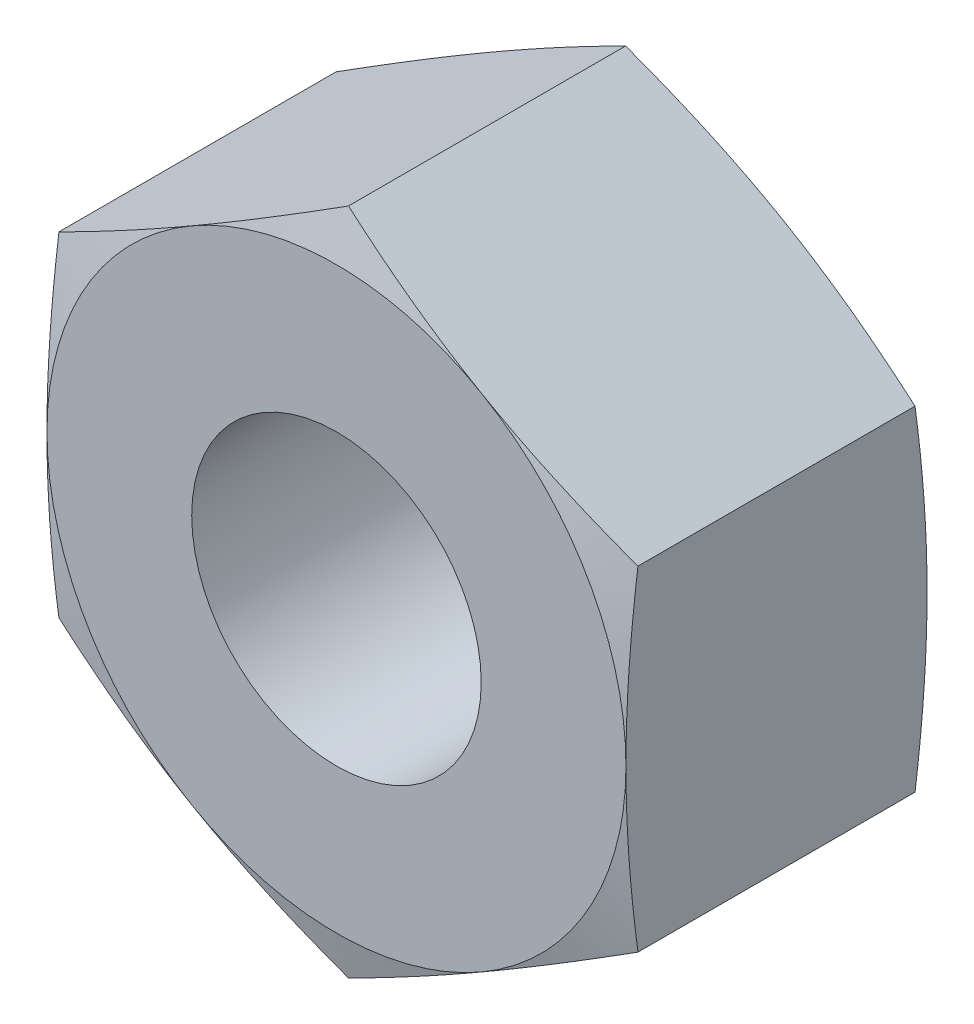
ISO-10303-21;
HEADER;
FILE_DESCRIPTION(('STEP AP214'),'2;1');
FILE_NAME('part.step','',(''),(''),'','','');
FILE_SCHEMA(('AUTOMOTIVE_DESIGN { 1 0 10303 214 1 1 1 1 }'));
ENDSEC;
DATA;
#1=APPLICATION_CONTEXT('core data for automotive mechanical design processes');
#2=APPLICATION_PROTOCOL_DEFINITION('international standard','automotive_design',2000,#1);
#3=PRODUCT_CONTEXT('',#1,'mechanical');
#4=PRODUCT('Part','Part','',(#3));
#5=PRODUCT_RELATED_PRODUCT_CATEGORY('part','',(#4));
#6=PRODUCT_DEFINITION_FORMATION('','',#4);
#7=PRODUCT_DEFINITION_CONTEXT('part definition',#1,'design');
#8=PRODUCT_DEFINITION('design','',#6,#7);
#9=PRODUCT_DEFINITION_SHAPE('','',#8);
#10=(LENGTH_UNIT() NAMED_UNIT(*) SI_UNIT(.MILLI.,.METRE.));
#11=(NAMED_UNIT(*) PLANE_ANGLE_UNIT() SI_UNIT($,.RADIAN.));
#12=(NAMED_UNIT(*) SI_UNIT($,.STERADIAN.) SOLID_ANGLE_UNIT());
#13=UNCERTAINTY_MEASURE_WITH_UNIT(LENGTH_MEASURE(1.E-05),#10,'distance_accuracy_value','');
#14=(GEOMETRIC_REPRESENTATION_CONTEXT(3) GLOBAL_UNCERTAINTY_ASSIGNED_CONTEXT((#13)) GLOBAL_UNIT_ASSIGNED_CONTEXT((#10,
#11,#12)) REPRESENTATION_CONTEXT('',''));
#15=CARTESIAN_POINT('',(0.,0.,0.));
#16=DIRECTION('',(0.,0.,1.));
#17=DIRECTION('',(1.,0.,0.));
#18=AXIS2_PLACEMENT_3D('',#15,#16,#17);
#19=CARTESIAN_POINT('',(0.,5.77350269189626,5.2));
#20=DIRECTION('',(0.5,-0.866025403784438,0.));
#21=DIRECTION('',(0.866025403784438,0.5,0.));
#22=AXIS2_PLACEMENT_3D('',#19,#20,#21);
#23=PLANE('',#22);
#24=CARTESIAN_POINT('',(-5.0002,2.88663587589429,0.20729036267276));
#25=CARTESIAN_POINT('',(-4.79254599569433,3.00652497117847,0.175152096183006));
#26=CARTESIAN_POINT('',(-4.58451548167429,3.1266314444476,0.145975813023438));
#27=CARTESIAN_POINT('',(-4.16771975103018,3.36726857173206,0.0947157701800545));
#28=CARTESIAN_POINT('',(-3.95895427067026,3.48779937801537,0.0726348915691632));
#29=CARTESIAN_POINT('',(-3.54195440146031,3.72855436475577,0.0368547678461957));
#30=CARTESIAN_POINT('',(-3.33372283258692,3.8487769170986,0.0231128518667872));
#31=CARTESIAN_POINT('',(-2.91699413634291,4.08937534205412,0.00468634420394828));
#32=CARTESIAN_POINT('',(-2.70849706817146,4.20975118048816,0.));
#33=CARTESIAN_POINT('',(-2.29150293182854,4.45050285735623,0.));
#34=CARTESIAN_POINT('',(-2.08300586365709,4.57087869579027,0.00468634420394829));
#35=CARTESIAN_POINT('',(-1.66627716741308,4.81147712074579,0.0231128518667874));
#36=CARTESIAN_POINT('',(-1.45804559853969,4.93169967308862,0.0368547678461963));
#37=CARTESIAN_POINT('',(-1.04104572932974,5.17245465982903,0.0726348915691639));
#38=CARTESIAN_POINT('',(-0.832280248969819,5.29298546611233,0.0947157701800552));
#39=CARTESIAN_POINT('',(-0.415484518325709,5.53362259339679,0.145975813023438));
#40=CARTESIAN_POINT('',(-0.207454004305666,5.65372906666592,0.175152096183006));
#41=CARTESIAN_POINT('',(0.000199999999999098,5.7736181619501,0.207290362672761));
#42=B_SPLINE_CURVE_WITH_KNOTS('',3,(#24,#25,#26,#27,#28,#29,#30,#31,#32,#33,#34,#35,#36,#37,#38,
#39,#40,#41),.UNSPECIFIED.,.F.,.F.,(4,2,2,2,2,2,2,2,4),(0.,0.725805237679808,1.45190481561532,
2.17425686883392,2.89646911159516,3.6186813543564,4.341033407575,5.06713298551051,
5.79293822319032),.UNSPECIFIED.);
#43=CARTESIAN_POINT('',(-5.,2.88675134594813,0.2072594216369));
#44=VERTEX_POINT('',#43);
#45=CARTESIAN_POINT('',(-2.5,4.33012701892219,0.));
#46=VERTEX_POINT('',#45);
#47=EDGE_CURVE('E55',#44,#46,#42,.T.);
#48=ORIENTED_EDGE('',*,*,#47,.F.);
#49=DIRECTION('',(0.,0.,-1.));
#50=VECTOR('',#49,1.);
#51=CARTESIAN_POINT('',(-5.,2.88675134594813,5.2));
#52=LINE('',#51,#50);
#53=CARTESIAN_POINT('',(-5.,2.88675134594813,4.9927405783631));
#54=VERTEX_POINT('',#53);
#55=EDGE_CURVE('E279',#54,#44,#52,.T.);
#56=ORIENTED_EDGE('',*,*,#55,.F.);
#57=CARTESIAN_POINT('',(0.000200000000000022,5.7736181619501,4.99270963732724));
#58=CARTESIAN_POINT('',(-0.207454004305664,5.65372906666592,5.02484790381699));
#59=CARTESIAN_POINT('',(-0.415484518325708,5.53362259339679,5.05402418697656));
#60=CARTESIAN_POINT('',(-0.832280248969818,5.29298546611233,5.10528422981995));
#61=CARTESIAN_POINT('',(-1.04104572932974,5.17245465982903,5.12736510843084));
#62=CARTESIAN_POINT('',(-1.45804559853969,4.93169967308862,5.1631452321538));
#63=CARTESIAN_POINT('',(-1.66627716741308,4.81147712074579,5.17688714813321));
#64=CARTESIAN_POINT('',(-2.08300586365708,4.57087869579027,5.19531365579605));
#65=CARTESIAN_POINT('',(-2.29150293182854,4.45050285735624,5.2));
#66=CARTESIAN_POINT('',(-2.70849706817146,4.20975118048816,5.2));
#67=CARTESIAN_POINT('',(-2.91699413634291,4.08937534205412,5.19531365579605));
#68=CARTESIAN_POINT('',(-3.33372283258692,3.8487769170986,5.17688714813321));
#69=CARTESIAN_POINT('',(-3.54195440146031,3.72855436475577,5.1631452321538));
#70=CARTESIAN_POINT('',(-3.95895427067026,3.48779937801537,5.12736510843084));
#71=CARTESIAN_POINT('',(-4.16771975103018,3.36726857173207,5.10528422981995));
#72=CARTESIAN_POINT('',(-4.58451548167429,3.1266314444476,5.05402418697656));
#73=CARTESIAN_POINT('',(-4.79254599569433,3.00652497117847,5.02484790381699));
#74=CARTESIAN_POINT('',(-5.0002,2.88663587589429,4.99270963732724));
#75=B_SPLINE_CURVE_WITH_KNOTS('',3,(#57,#58,#59,#60,#61,#62,#63,#64,#65,#66,#67,#68,#69,#70,#71,
#72,#73,#74),.UNSPECIFIED.,.F.,.F.,(4,2,2,2,2,2,2,2,4),(0.,0.725805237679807,1.45190481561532,
2.17425686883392,2.89646911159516,3.6186813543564,4.341033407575,5.06713298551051,
5.79293822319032),.UNSPECIFIED.);
#76=CARTESIAN_POINT('',(-2.5,4.3301270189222,5.2));
#77=VERTEX_POINT('',#76);
#78=EDGE_CURVE('E220',#77,#54,#75,.T.);
#79=ORIENTED_EDGE('',*,*,#78,.F.);
#80=CARTESIAN_POINT('',(0.,5.77350269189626,4.9927405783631));
#81=VERTEX_POINT('',#80);
#82=EDGE_CURVE('E300',#81,#77,#75,.T.);
#83=ORIENTED_EDGE('',*,*,#82,.F.);
#84=DIRECTION('',(0.,0.,-1.));
#85=VECTOR('',#84,1.);
#86=CARTESIAN_POINT('',(0.,5.77350269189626,5.2));
#87=LINE('',#86,#85);
#88=CARTESIAN_POINT('',(0.,5.77350269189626,0.207259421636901));
#89=VERTEX_POINT('',#88);
#90=EDGE_CURVE('E308',#81,#89,#87,.T.);
#91=ORIENTED_EDGE('',*,*,#90,.T.);
#92=EDGE_CURVE('E140',#46,#89,#42,.T.);
#93=ORIENTED_EDGE('',*,*,#92,.F.);
#94=EDGE_LOOP('',(#48,#56,#79,#83,#91,#93));
#95=FACE_BOUND('',#94,.T.);
#96=ADVANCED_FACE('F39',(#95),#23,.F.);
#97=CARTESIAN_POINT('',(-5.,2.88675134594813,5.2));
#98=DIRECTION('',(1.,0.,0.));
#99=DIRECTION('',(0.,1.,0.));
#100=AXIS2_PLACEMENT_3D('',#97,#98,#99);
#101=PLANE('',#100);
#102=CARTESIAN_POINT('',(-5.,-7.7097656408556,1.12247948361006));
#103=CARTESIAN_POINT('',(-5.,-7.48193171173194,1.07127339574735));
#104=CARTESIAN_POINT('',(-5.,-7.25395720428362,1.02068177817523));
#105=CARTESIAN_POINT('',(-5.,-6.79765775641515,0.921059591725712));
#106=CARTESIAN_POINT('',(-5.,-6.56933280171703,0.872029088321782));
#107=CARTESIAN_POINT('',(-5.,-6.11207667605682,0.775822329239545));
#108=CARTESIAN_POINT('',(-5.,-5.88314514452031,0.728647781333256));
#109=CARTESIAN_POINT('',(-5.,-5.42481045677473,0.636649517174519));
#110=CARTESIAN_POINT('',(-5.,-5.19540730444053,0.591825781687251));
#111=CARTESIAN_POINT('',(-5.,-4.73816702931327,0.505491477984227));
#112=CARTESIAN_POINT('',(-5.,-4.5103349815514,0.463954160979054));
#113=CARTESIAN_POINT('',(-5.,-4.05405381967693,0.384425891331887));
#114=CARTESIAN_POINT('',(-5.,-3.82560471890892,0.346434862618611));
#115=CARTESIAN_POINT('',(-5.,-3.36802992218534,0.27483728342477));
#116=CARTESIAN_POINT('',(-5.,-3.13890427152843,0.241230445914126));
#117=CARTESIAN_POINT('',(-5.,-2.6799220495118,0.179378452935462));
#118=CARTESIAN_POINT('',(-5.,-2.45006547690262,0.151133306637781));
#119=CARTESIAN_POINT('',(-5.,-1.98697016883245,0.100784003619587));
#120=CARTESIAN_POINT('',(-5.,-1.75372314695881,0.0787549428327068));
#121=CARTESIAN_POINT('',(-5.,-1.28662743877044,0.0423507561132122));
#122=CARTESIAN_POINT('',(-5.,-1.05277876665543,0.0279754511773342));
#123=CARTESIAN_POINT('',(-5.,-0.58483373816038,0.00771580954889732));
#124=CARTESIAN_POINT('',(-5.,-0.350737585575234,0.00182686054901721));
#125=CARTESIAN_POINT('',(-5.,0.117510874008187,-0.00109820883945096));
#126=CARTESIAN_POINT('',(-5.,0.351663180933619,0.00186565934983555));
#127=CARTESIAN_POINT('',(-5.,0.820811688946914,0.0164889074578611));
#128=CARTESIAN_POINT('',(-5.,1.0558065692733,0.0281898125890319));
#129=CARTESIAN_POINT('',(-5.,1.52526098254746,0.0596239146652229));
#130=CARTESIAN_POINT('',(-5.,1.75972048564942,0.079357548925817));
#131=CARTESIAN_POINT('',(-5.,2.22810530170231,0.125841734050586));
#132=CARTESIAN_POINT('',(-5.,2.46203009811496,0.152597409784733));
#133=CARTESIAN_POINT('',(-5.,2.9291205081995,0.211989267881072));
#134=CARTESIAN_POINT('',(-5.,3.16228612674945,0.244625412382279));
#135=CARTESIAN_POINT('',(-5.,3.69202155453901,0.324358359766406));
#136=CARTESIAN_POINT('',(-5.,3.98836298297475,0.37296204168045));
#137=CARTESIAN_POINT('',(-5.,4.58001486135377,0.476113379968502));
#138=CARTESIAN_POINT('',(-5.,4.87532524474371,0.530661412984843));
#139=CARTESIAN_POINT('',(-5.,5.46514526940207,0.64426883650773));
#140=CARTESIAN_POINT('',(-5.,5.75965469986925,0.703329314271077));
#141=CARTESIAN_POINT('',(-5.,6.34795589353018,0.824870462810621));
#142=CARTESIAN_POINT('',(-5.,6.64174767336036,0.887351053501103));
#143=CARTESIAN_POINT('',(-5.,7.22895510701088,1.01498162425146));
#144=CARTESIAN_POINT('',(-5.,7.52237037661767,1.08013336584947));
#145=CARTESIAN_POINT('',(-5.,8.10873904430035,1.21248646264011));
#146=CARTESIAN_POINT('',(-5.,8.40169243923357,1.27968783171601));
#147=CARTESIAN_POINT('',(-5.,9.27990964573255,1.48366665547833));
#148=CARTESIAN_POINT('',(-5.,9.86461682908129,1.62283789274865));
#149=CARTESIAN_POINT('',(-5.,11.0231475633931,1.90287054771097));
#150=CARTESIAN_POINT('',(-5.,11.5969877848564,2.04366346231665));
#151=CARTESIAN_POINT('',(-5.,12.7440224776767,2.32795589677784));
#152=CARTESIAN_POINT('',(-4.99999999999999,13.3172169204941,2.47145553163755));
#153=CARTESIAN_POINT('',(-4.99999999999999,14.4619716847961,2.76006048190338));
#154=CARTESIAN_POINT('',(-4.99999999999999,15.0335329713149,2.90516197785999));
#155=CARTESIAN_POINT('',(-4.99999999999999,16.1762645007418,3.19677110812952));
#156=CARTESIAN_POINT('',(-4.99999999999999,16.7474347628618,3.34327866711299));
#157=CARTESIAN_POINT('',(-4.99999999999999,17.3184830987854,3.49025549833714));
#158=B_SPLINE_CURVE_WITH_KNOTS('',3,(#102,#103,#104,#105,#106,#107,#108,#109,#110,#111,#112,
#113,#114,#115,#116,#117,#118,#119,#120,#121,#122,#123,#124,#125,#126,#127,#128,#129,#130,#131,
#132,#133,#134,#135,#136,#137,#138,#139,#140,#141,#142,#143,#144,#145,#146,#147,#148,#149,#150,
#151,#152,#153,#154,#155,#156,#157),.UNSPECIFIED.,.F.,.F.,(4,2,2,2,2,2,2,2,2,2,2,2,2,2,2,2,2,2,
2,2,2,2,2,2,2,2,2,4),(0.,0.700554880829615,1.40113910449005,2.10235357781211,2.80356231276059,
3.49830258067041,4.19302794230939,4.8877077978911,5.58238884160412,6.28513429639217,
6.98786331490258,7.69021025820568,8.39255629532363,9.09826184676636,9.80400582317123,
10.5102663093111,11.2165222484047,12.1173398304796,13.0182145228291,13.9193069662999,
14.8203783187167,15.7220537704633,16.6237353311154,18.4268331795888,20.1994050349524,
21.9720523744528,23.7411267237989,25.5101068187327),.UNSPECIFIED.);
#159=CARTESIAN_POINT('',(-5.,-2.88675134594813,0.207259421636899));
#160=VERTEX_POINT('',#159);
#161=CARTESIAN_POINT('',(-5.,0.,0.));
#162=VERTEX_POINT('',#161);
#163=EDGE_CURVE('E63',#160,#162,#158,.T.);
#164=ORIENTED_EDGE('',*,*,#163,.F.);
#165=DIRECTION('',(0.,0.,-1.));
#166=VECTOR('',#165,1.);
#167=CARTESIAN_POINT('',(-5.,-2.88675134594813,5.2));
#168=LINE('',#167,#166);
#169=CARTESIAN_POINT('',(-5.,-2.88675134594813,4.9927405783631));
#170=VERTEX_POINT('',#169);
#171=EDGE_CURVE('E277',#170,#160,#168,.T.);
#172=ORIENTED_EDGE('',*,*,#171,.F.);
#173=CARTESIAN_POINT('',(-5.,-7.7097656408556,4.07752051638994));
#174=CARTESIAN_POINT('',(-5.,-7.48193171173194,4.12872660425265));
#175=CARTESIAN_POINT('',(-5.,-7.25395720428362,4.17931822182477));
#176=CARTESIAN_POINT('',(-5.,-6.79765775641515,4.27894040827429));
#177=CARTESIAN_POINT('',(-5.,-6.56933280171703,4.32797091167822));
#178=CARTESIAN_POINT('',(-5.,-6.11207667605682,4.42417767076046));
#179=CARTESIAN_POINT('',(-5.,-5.88314514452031,4.47135221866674));
#180=CARTESIAN_POINT('',(-5.,-5.42481045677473,4.56335048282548));
#181=CARTESIAN_POINT('',(-5.,-5.19540730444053,4.60817421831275));
#182=CARTESIAN_POINT('',(-5.,-4.73816702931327,4.69450852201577));
#183=CARTESIAN_POINT('',(-5.,-4.5103349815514,4.73604583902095));
#184=CARTESIAN_POINT('',(-5.,-4.05405381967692,4.81557410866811));
#185=CARTESIAN_POINT('',(-5.,-3.82560471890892,4.85356513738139));
#186=CARTESIAN_POINT('',(-5.,-3.36802992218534,4.92516271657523));
#187=CARTESIAN_POINT('',(-5.,-3.13890427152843,4.95876955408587));
#188=CARTESIAN_POINT('',(-5.,-2.6799220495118,5.02062154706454));
#189=CARTESIAN_POINT('',(-5.,-2.45006547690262,5.04886669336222));
#190=CARTESIAN_POINT('',(-5.,-1.98697016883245,5.09921599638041));
#191=CARTESIAN_POINT('',(-5.,-1.75372314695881,5.12124505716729));
#192=CARTESIAN_POINT('',(-5.,-1.28662743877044,5.15764924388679));
#193=CARTESIAN_POINT('',(-5.,-1.05277876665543,5.17202454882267));
#194=CARTESIAN_POINT('',(-5.,-0.584833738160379,5.1922841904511));
#195=CARTESIAN_POINT('',(-5.,-0.350737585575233,5.19817313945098));
#196=CARTESIAN_POINT('',(-5.,0.117510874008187,5.20109820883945));
#197=CARTESIAN_POINT('',(-5.,0.35166318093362,5.19813434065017));
#198=CARTESIAN_POINT('',(-5.,0.820811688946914,5.18351109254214));
#199=CARTESIAN_POINT('',(-5.,1.0558065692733,5.17181018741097));
#200=CARTESIAN_POINT('',(-5.,1.52526098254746,5.14037608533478));
#201=CARTESIAN_POINT('',(-5.,1.75972048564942,5.12064245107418));
#202=CARTESIAN_POINT('',(-5.,2.22810530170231,5.07415826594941));
#203=CARTESIAN_POINT('',(-5.,2.46203009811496,5.04740259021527));
#204=CARTESIAN_POINT('',(-5.,2.9291205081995,4.98801073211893));
#205=CARTESIAN_POINT('',(-5.,3.16228612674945,4.95537458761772));
#206=CARTESIAN_POINT('',(-5.,3.69202155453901,4.87564164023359));
#207=CARTESIAN_POINT('',(-5.,3.98836298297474,4.82703795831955));
#208=CARTESIAN_POINT('',(-5.,4.58001486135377,4.7238866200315));
#209=CARTESIAN_POINT('',(-5.,4.87532524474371,4.66933858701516));
#210=CARTESIAN_POINT('',(-5.,5.46514526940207,4.55573116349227));
#211=CARTESIAN_POINT('',(-5.,5.75965469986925,4.49667068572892));
#212=CARTESIAN_POINT('',(-5.,6.34795589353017,4.37512953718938));
#213=CARTESIAN_POINT('',(-5.,6.64174767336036,4.3126489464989));
#214=CARTESIAN_POINT('',(-5.,7.22895510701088,4.18501837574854));
#215=CARTESIAN_POINT('',(-5.,7.52237037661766,4.11986663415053));
#216=CARTESIAN_POINT('',(-5.,8.10873904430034,3.98751353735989));
#217=CARTESIAN_POINT('',(-5.,8.40169243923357,3.92031216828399));
#218=CARTESIAN_POINT('',(-5.,9.27990964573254,3.71633334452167));
#219=CARTESIAN_POINT('',(-5.,9.86461682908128,3.57716210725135));
#220=CARTESIAN_POINT('',(-5.,11.0231475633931,3.29712945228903));
#221=CARTESIAN_POINT('',(-5.,11.5969877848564,3.15633653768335));
#222=CARTESIAN_POINT('',(-5.,12.7440224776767,2.87204410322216));
#223=CARTESIAN_POINT('',(-4.99999999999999,13.3172169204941,2.72854446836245));
#224=CARTESIAN_POINT('',(-4.99999999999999,14.4619716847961,2.43993951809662));
#225=CARTESIAN_POINT('',(-4.99999999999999,15.0335329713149,2.29483802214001));
#226=CARTESIAN_POINT('',(-4.99999999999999,16.1762645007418,2.00322889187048));
#227=CARTESIAN_POINT('',(-4.99999999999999,16.7474347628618,1.85672133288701));
#228=CARTESIAN_POINT('',(-4.99999999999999,17.3184830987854,1.70974450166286));
#229=B_SPLINE_CURVE_WITH_KNOTS('',3,(#173,#174,#175,#176,#177,#178,#179,#180,#181,#182,#183,
#184,#185,#186,#187,#188,#189,#190,#191,#192,#193,#194,#195,#196,#197,#198,#199,#200,#201,#202,
#203,#204,#205,#206,#207,#208,#209,#210,#211,#212,#213,#214,#215,#216,#217,#218,#219,#220,#221,
#222,#223,#224,#225,#226,#227,#228),.UNSPECIFIED.,.F.,.F.,(4,2,2,2,2,2,2,2,2,2,2,2,2,2,2,2,2,2,
2,2,2,2,2,2,2,2,2,4),(0.,0.700554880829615,1.40113910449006,2.10235357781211,2.80356231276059,
3.49830258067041,4.19302794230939,4.8877077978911,5.58238884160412,6.28513429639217,
6.98786331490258,7.69021025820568,8.39255629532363,9.09826184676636,9.80400582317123,
10.5102663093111,11.2165222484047,12.1173398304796,13.0182145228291,13.9193069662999,
14.8203783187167,15.7220537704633,16.6237353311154,18.4268331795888,20.1994050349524,
21.9720523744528,23.7411267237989,25.5101068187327),.UNSPECIFIED.);
#230=CARTESIAN_POINT('',(-5.,0.,5.2));
#231=VERTEX_POINT('',#230);
#232=EDGE_CURVE('E240',#231,#170,#229,.F.);
#233=ORIENTED_EDGE('',*,*,#232,.F.);
#234=EDGE_CURVE('E316',#54,#231,#229,.F.);
#235=ORIENTED_EDGE('',*,*,#234,.F.);
#236=ORIENTED_EDGE('',*,*,#55,.T.);
#237=EDGE_CURVE('E162',#162,#44,#158,.T.);
#238=ORIENTED_EDGE('',*,*,#237,.F.);
#239=EDGE_LOOP('',(#164,#172,#233,#235,#236,#238));
#240=FACE_BOUND('',#239,.T.);
#241=ADVANCED_FACE('F247',(#240),#101,.F.);
#242=CARTESIAN_POINT('',(0.,-5.77350269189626,5.2));
#243=DIRECTION('',(0.5,0.866025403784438,0.));
#244=DIRECTION('',(-0.866025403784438,0.5,0.));
#245=AXIS2_PLACEMENT_3D('',#242,#243,#244);
#246=PLANE('',#245);
#247=CARTESIAN_POINT('',(0.000200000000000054,-5.7736181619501,0.207290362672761));
#248=CARTESIAN_POINT('',(-0.207454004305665,-5.65372906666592,0.175152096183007));
#249=CARTESIAN_POINT('',(-0.415484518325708,-5.53362259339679,0.145975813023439));
#250=CARTESIAN_POINT('',(-0.832280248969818,-5.29298546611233,0.0947157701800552));
#251=CARTESIAN_POINT('',(-1.04104572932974,-5.17245465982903,0.0726348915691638));
#252=CARTESIAN_POINT('',(-1.45804559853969,-4.93169967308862,0.0368547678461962));
#253=CARTESIAN_POINT('',(-1.66627716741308,-4.81147712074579,0.0231128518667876));
#254=CARTESIAN_POINT('',(-2.08300586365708,-4.57087869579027,0.00468634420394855));
#255=CARTESIAN_POINT('',(-2.29150293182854,-4.45050285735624,0.));
#256=CARTESIAN_POINT('',(-2.70849706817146,-4.20975118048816,0.));
#257=CARTESIAN_POINT('',(-2.91699413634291,-4.08937534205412,0.00468634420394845));
#258=CARTESIAN_POINT('',(-3.33372283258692,-3.8487769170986,0.0231128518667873));
#259=CARTESIAN_POINT('',(-3.54195440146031,-3.72855436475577,0.0368547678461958));
#260=CARTESIAN_POINT('',(-3.95895427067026,-3.48779937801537,0.0726348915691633));
#261=CARTESIAN_POINT('',(-4.16771975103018,-3.36726857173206,0.0947157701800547));
#262=CARTESIAN_POINT('',(-4.58451548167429,-3.1266314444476,0.145975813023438));
#263=CARTESIAN_POINT('',(-4.79254599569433,-3.00652497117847,0.175152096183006));
#264=CARTESIAN_POINT('',(-5.0002,-2.88663587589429,0.20729036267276));
#265=B_SPLINE_CURVE_WITH_KNOTS('',3,(#247,#248,#249,#250,#251,#252,#253,#254,#255,#256,#257,
#258,#259,#260,#261,#262,#263,#264),.UNSPECIFIED.,.F.,.F.,(4,2,2,2,2,2,2,2,4),(0.,
0.725805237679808,1.45190481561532,2.17425686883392,2.89646911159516,3.6186813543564,
4.34103340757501,5.06713298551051,5.79293822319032),.UNSPECIFIED.);
#266=CARTESIAN_POINT('',(0.,-5.77350269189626,0.207259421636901));
#267=VERTEX_POINT('',#266);
#268=CARTESIAN_POINT('',(-2.5,-4.33012701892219,0.));
#269=VERTEX_POINT('',#268);
#270=EDGE_CURVE('E256',#267,#269,#265,.T.);
#271=ORIENTED_EDGE('',*,*,#270,.F.);
#272=DIRECTION('',(0.,0.,-1.));
#273=VECTOR('',#272,1.);
#274=CARTESIAN_POINT('',(0.,-5.77350269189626,5.2));
#275=LINE('',#274,#273);
#276=CARTESIAN_POINT('',(0.,-5.77350269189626,4.9927405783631));
#277=VERTEX_POINT('',#276);
#278=EDGE_CURVE('E271',#277,#267,#275,.T.);
#279=ORIENTED_EDGE('',*,*,#278,.F.);
#280=CARTESIAN_POINT('',(-5.0002,-2.88663587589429,4.99270963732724));
#281=CARTESIAN_POINT('',(-4.79254599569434,-3.00652497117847,5.02484790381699));
#282=CARTESIAN_POINT('',(-4.58451548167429,-3.1266314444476,5.05402418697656));
#283=CARTESIAN_POINT('',(-4.16771975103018,-3.36726857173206,5.10528422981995));
#284=CARTESIAN_POINT('',(-3.95895427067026,-3.48779937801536,5.12736510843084));
#285=CARTESIAN_POINT('',(-3.54195440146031,-3.72855436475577,5.1631452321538));
#286=CARTESIAN_POINT('',(-3.33372283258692,-3.8487769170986,5.17688714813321));
#287=CARTESIAN_POINT('',(-2.91699413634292,-4.08937534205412,5.19531365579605));
#288=CARTESIAN_POINT('',(-2.70849706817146,-4.20975118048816,5.2));
#289=CARTESIAN_POINT('',(-2.29150293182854,-4.45050285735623,5.2));
#290=CARTESIAN_POINT('',(-2.08300586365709,-4.57087869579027,5.19531365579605));
#291=CARTESIAN_POINT('',(-1.66627716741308,-4.81147712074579,5.17688714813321));
#292=CARTESIAN_POINT('',(-1.45804559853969,-4.93169967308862,5.1631452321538));
#293=CARTESIAN_POINT('',(-1.04104572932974,-5.17245465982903,5.12736510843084));
#294=CARTESIAN_POINT('',(-0.83228024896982,-5.29298546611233,5.10528422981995));
#295=CARTESIAN_POINT('',(-0.41548451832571,-5.53362259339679,5.05402418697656));
#296=CARTESIAN_POINT('',(-0.207454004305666,-5.65372906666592,5.02484790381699));
#297=CARTESIAN_POINT('',(0.000199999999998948,-5.7736181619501,4.99270963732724));
#298=B_SPLINE_CURVE_WITH_KNOTS('',3,(#280,#281,#282,#283,#284,#285,#286,#287,#288,#289,#290,
#291,#292,#293,#294,#295,#296,#297),.UNSPECIFIED.,.F.,.F.,(4,2,2,2,2,2,2,2,4),(0.,
0.725805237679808,1.45190481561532,2.17425686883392,2.89646911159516,3.6186813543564,
4.341033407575,5.06713298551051,5.79293822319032),.UNSPECIFIED.);
#299=CARTESIAN_POINT('',(-2.5,-4.3301270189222,5.2));
#300=VERTEX_POINT('',#299);
#301=EDGE_CURVE('E234',#300,#277,#298,.T.);
#302=ORIENTED_EDGE('',*,*,#301,.F.);
#303=EDGE_CURVE('E238',#170,#300,#298,.T.);
#304=ORIENTED_EDGE('',*,*,#303,.F.);
#305=ORIENTED_EDGE('',*,*,#171,.T.);
#306=EDGE_CURVE('E251',#269,#160,#265,.T.);
#307=ORIENTED_EDGE('',*,*,#306,.F.);
#308=EDGE_LOOP('',(#271,#279,#302,#304,#305,#307));
#309=FACE_BOUND('',#308,.T.);
#310=ADVANCED_FACE('F244',(#309),#246,.F.);
#311=CARTESIAN_POINT('',(0.,-5.77350269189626,5.2));
#312=DIRECTION('',(-0.5,0.866025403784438,0.));
#313=DIRECTION('',(-0.866025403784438,-0.5,0.));
#314=AXIS2_PLACEMENT_3D('',#311,#312,#313);
#315=PLANE('',#314);
#316=CARTESIAN_POINT('',(5.0002,-2.88663587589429,0.20729036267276));
#317=CARTESIAN_POINT('',(4.79254599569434,-3.00652497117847,0.175152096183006));
#318=CARTESIAN_POINT('',(4.58451548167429,-3.1266314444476,0.145975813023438));
#319=CARTESIAN_POINT('',(4.16771975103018,-3.36726857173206,0.0947157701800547));
#320=CARTESIAN_POINT('',(3.95895427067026,-3.48779937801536,0.0726348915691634));
#321=CARTESIAN_POINT('',(3.54195440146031,-3.72855436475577,0.0368547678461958));
#322=CARTESIAN_POINT('',(3.33372283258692,-3.8487769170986,0.0231128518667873));
#323=CARTESIAN_POINT('',(2.91699413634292,-4.08937534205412,0.0046863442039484));
#324=CARTESIAN_POINT('',(2.70849706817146,-4.20975118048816,0.));
#325=CARTESIAN_POINT('',(2.29150293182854,-4.45050285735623,0.));
#326=CARTESIAN_POINT('',(2.08300586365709,-4.57087869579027,0.00468634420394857));
#327=CARTESIAN_POINT('',(1.66627716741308,-4.81147712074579,0.0231128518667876));
#328=CARTESIAN_POINT('',(1.45804559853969,-4.93169967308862,0.0368547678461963));
#329=CARTESIAN_POINT('',(1.04104572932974,-5.17245465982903,0.0726348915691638));
#330=CARTESIAN_POINT('',(0.83228024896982,-5.29298546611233,0.0947157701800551));
#331=CARTESIAN_POINT('',(0.415484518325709,-5.53362259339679,0.145975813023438));
#332=CARTESIAN_POINT('',(0.207454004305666,-5.65372906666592,0.175152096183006));
#333=CARTESIAN_POINT('',(-0.000199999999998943,-5.7736181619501,0.207290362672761));
#334=B_SPLINE_CURVE_WITH_KNOTS('',3,(#316,#317,#318,#319,#320,#321,#322,#323,#324,#325,#326,
#327,#328,#329,#330,#331,#332,#333),.UNSPECIFIED.,.F.,.F.,(4,2,2,2,2,2,2,2,4),(0.,
0.725805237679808,1.45190481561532,2.17425686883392,2.89646911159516,3.6186813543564,
4.341033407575,5.06713298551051,5.79293822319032),.UNSPECIFIED.);
#335=CARTESIAN_POINT('',(5.,-2.88675134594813,0.207259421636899));
#336=VERTEX_POINT('',#335);
#337=CARTESIAN_POINT('',(2.5,-4.33012701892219,0.));
#338=VERTEX_POINT('',#337);
#339=EDGE_CURVE('E149',#336,#338,#334,.T.);
#340=ORIENTED_EDGE('',*,*,#339,.F.);
#341=DIRECTION('',(0.,0.,-1.));
#342=VECTOR('',#341,1.);
#343=CARTESIAN_POINT('',(5.,-2.88675134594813,5.2));
#344=LINE('',#343,#342);
#345=CARTESIAN_POINT('',(5.,-2.88675134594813,4.9927405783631));
#346=VERTEX_POINT('',#345);
#347=EDGE_CURVE('E161',#346,#336,#344,.T.);
#348=ORIENTED_EDGE('',*,*,#347,.F.);
#349=CARTESIAN_POINT('',(-0.000200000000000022,-5.7736181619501,4.99270963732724));
#350=CARTESIAN_POINT('',(0.207454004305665,-5.65372906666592,5.02484790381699));
#351=CARTESIAN_POINT('',(0.415484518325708,-5.53362259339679,5.05402418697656));
#352=CARTESIAN_POINT('',(0.832280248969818,-5.29298546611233,5.10528422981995));
#353=CARTESIAN_POINT('',(1.04104572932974,-5.17245465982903,5.12736510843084));
#354=CARTESIAN_POINT('',(1.45804559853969,-4.93169967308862,5.1631452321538));
#355=CARTESIAN_POINT('',(1.66627716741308,-4.81147712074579,5.17688714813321));
#356=CARTESIAN_POINT('',(2.08300586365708,-4.57087869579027,5.19531365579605));
#357=CARTESIAN_POINT('',(2.29150293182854,-4.45050285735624,5.2));
#358=CARTESIAN_POINT('',(2.70849706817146,-4.20975118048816,5.2));
#359=CARTESIAN_POINT('',(2.91699413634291,-4.08937534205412,5.19531365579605));
#360=CARTESIAN_POINT('',(3.33372283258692,-3.8487769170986,5.17688714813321));
#361=CARTESIAN_POINT('',(3.54195440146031,-3.72855436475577,5.1631452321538));
#362=CARTESIAN_POINT('',(3.95895427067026,-3.48779937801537,5.12736510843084));
#363=CARTESIAN_POINT('',(4.16771975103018,-3.36726857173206,5.10528422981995));
#364=CARTESIAN_POINT('',(4.58451548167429,-3.1266314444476,5.05402418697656));
#365=CARTESIAN_POINT('',(4.79254599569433,-3.00652497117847,5.02484790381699));
#366=CARTESIAN_POINT('',(5.0002,-2.88663587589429,4.99270963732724));
#367=B_SPLINE_CURVE_WITH_KNOTS('',3,(#349,#350,#351,#352,#353,#354,#355,#356,#357,#358,#359,
#360,#361,#362,#363,#364,#365,#366),.UNSPECIFIED.,.F.,.F.,(4,2,2,2,2,2,2,2,4),(0.,
0.725805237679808,1.45190481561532,2.17425686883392,2.89646911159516,3.6186813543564,
4.34103340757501,5.06713298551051,5.79293822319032),.UNSPECIFIED.);
#368=CARTESIAN_POINT('',(2.5,-4.3301270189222,5.2));
#369=VERTEX_POINT('',#368);
#370=EDGE_CURVE('E203',#369,#346,#367,.T.);
#371=ORIENTED_EDGE('',*,*,#370,.F.);
#372=EDGE_CURVE('E239',#277,#369,#367,.T.);
#373=ORIENTED_EDGE('',*,*,#372,.F.);
#374=ORIENTED_EDGE('',*,*,#278,.T.);
#375=EDGE_CURVE('E164',#338,#267,#334,.T.);
#376=ORIENTED_EDGE('',*,*,#375,.F.);
#377=EDGE_LOOP('',(#340,#348,#371,#373,#374,#376));
#378=FACE_BOUND('',#377,.T.);
#379=ADVANCED_FACE('F187',(#378),#315,.F.);
#380=CARTESIAN_POINT('',(5.,2.88675134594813,5.2));
#381=DIRECTION('',(-1.,0.,0.));
#382=DIRECTION('',(0.,-1.,0.));
#383=AXIS2_PLACEMENT_3D('',#380,#381,#382);
#384=PLANE('',#383);
#385=CARTESIAN_POINT('',(5.,-7.7097656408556,1.12247948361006));
#386=CARTESIAN_POINT('',(5.,-7.48193171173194,1.07127339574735));
#387=CARTESIAN_POINT('',(5.,-7.25395720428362,1.02068177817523));
#388=CARTESIAN_POINT('',(5.,-6.79765775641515,0.921059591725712));
#389=CARTESIAN_POINT('',(5.,-6.56933280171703,0.872029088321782));
#390=CARTESIAN_POINT('',(5.,-6.11207667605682,0.775822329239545));
#391=CARTESIAN_POINT('',(5.,-5.88314514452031,0.728647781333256));
#392=CARTESIAN_POINT('',(5.,-5.42481045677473,0.636649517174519));
#393=CARTESIAN_POINT('',(5.,-5.19540730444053,0.591825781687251));
#394=CARTESIAN_POINT('',(5.,-4.73816702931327,0.505491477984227));
#395=CARTESIAN_POINT('',(5.,-4.5103349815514,0.463954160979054));
#396=CARTESIAN_POINT('',(5.,-4.05405381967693,0.384425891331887));
#397=CARTESIAN_POINT('',(5.,-3.82560471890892,0.346434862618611));
#398=CARTESIAN_POINT('',(5.,-3.36802992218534,0.27483728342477));
#399=CARTESIAN_POINT('',(5.,-3.13890427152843,0.241230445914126));
#400=CARTESIAN_POINT('',(5.,-2.6799220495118,0.179378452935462));
#401=CARTESIAN_POINT('',(5.,-2.45006547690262,0.151133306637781));
#402=CARTESIAN_POINT('',(5.,-1.98697016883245,0.100784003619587));
#403=CARTESIAN_POINT('',(5.,-1.75372314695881,0.0787549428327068));
#404=CARTESIAN_POINT('',(5.,-1.28662743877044,0.0423507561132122));
#405=CARTESIAN_POINT('',(5.,-1.05277876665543,0.0279754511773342));
#406=CARTESIAN_POINT('',(5.,-0.58483373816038,0.00771580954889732));
#407=CARTESIAN_POINT('',(5.,-0.350737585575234,0.00182686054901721));
#408=CARTESIAN_POINT('',(5.,0.117510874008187,-0.00109820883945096));
#409=CARTESIAN_POINT('',(5.,0.351663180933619,0.00186565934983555));
#410=CARTESIAN_POINT('',(5.,0.820811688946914,0.0164889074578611));
#411=CARTESIAN_POINT('',(5.,1.0558065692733,0.0281898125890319));
#412=CARTESIAN_POINT('',(5.,1.52526098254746,0.0596239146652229));
#413=CARTESIAN_POINT('',(5.,1.75972048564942,0.079357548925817));
#414=CARTESIAN_POINT('',(5.,2.22810530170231,0.125841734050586));
#415=CARTESIAN_POINT('',(5.,2.46203009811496,0.152597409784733));
#416=CARTESIAN_POINT('',(5.,2.9291205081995,0.211989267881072));
#417=CARTESIAN_POINT('',(5.,3.16228612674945,0.244625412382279));
#418=CARTESIAN_POINT('',(5.,3.69202155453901,0.324358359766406));
#419=CARTESIAN_POINT('',(5.,3.98836298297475,0.37296204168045));
#420=CARTESIAN_POINT('',(5.,4.58001486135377,0.476113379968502));
#421=CARTESIAN_POINT('',(5.,4.87532524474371,0.530661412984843));
#422=CARTESIAN_POINT('',(5.,5.46514526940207,0.64426883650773));
#423=CARTESIAN_POINT('',(5.,5.75965469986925,0.703329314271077));
#424=CARTESIAN_POINT('',(5.,6.34795589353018,0.824870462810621));
#425=CARTESIAN_POINT('',(5.,6.64174767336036,0.887351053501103));
#426=CARTESIAN_POINT('',(5.,7.22895510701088,1.01498162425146));
#427=CARTESIAN_POINT('',(5.,7.52237037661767,1.08013336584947));
#428=CARTESIAN_POINT('',(5.,8.10873904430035,1.21248646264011));
#429=CARTESIAN_POINT('',(5.,8.40169243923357,1.27968783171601));
#430=CARTESIAN_POINT('',(5.,9.27990964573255,1.48366665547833));
#431=CARTESIAN_POINT('',(5.,9.86461682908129,1.62283789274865));
#432=CARTESIAN_POINT('',(5.,11.0231475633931,1.90287054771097));
#433=CARTESIAN_POINT('',(5.,11.5969877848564,2.04366346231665));
#434=CARTESIAN_POINT('',(5.,12.7440224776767,2.32795589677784));
#435=CARTESIAN_POINT('',(4.99999999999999,13.3172169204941,2.47145553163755));
#436=CARTESIAN_POINT('',(4.99999999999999,14.4619716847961,2.76006048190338));
#437=CARTESIAN_POINT('',(4.99999999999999,15.0335329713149,2.90516197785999));
#438=CARTESIAN_POINT('',(4.99999999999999,16.1762645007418,3.19677110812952));
#439=CARTESIAN_POINT('',(4.99999999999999,16.7474347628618,3.34327866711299));
#440=CARTESIAN_POINT('',(4.99999999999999,17.3184830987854,3.49025549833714));
#441=B_SPLINE_CURVE_WITH_KNOTS('',3,(#385,#386,#387,#388,#389,#390,#391,#392,#393,#394,#395,
#396,#397,#398,#399,#400,#401,#402,#403,#404,#405,#406,#407,#408,#409,#410,#411,#412,#413,#414,
#415,#416,#417,#418,#419,#420,#421,#422,#423,#424,#425,#426,#427,#428,#429,#430,#431,#432,#433,
#434,#435,#436,#437,#438,#439,#440),.UNSPECIFIED.,.F.,.F.,(4,2,2,2,2,2,2,2,2,2,2,2,2,2,2,2,2,2,
2,2,2,2,2,2,2,2,2,4),(0.,0.700554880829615,1.40113910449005,2.10235357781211,2.80356231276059,
3.49830258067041,4.19302794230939,4.8877077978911,5.58238884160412,6.28513429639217,
6.98786331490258,7.69021025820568,8.39255629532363,9.09826184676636,9.80400582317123,
10.5102663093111,11.2165222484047,12.1173398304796,13.0182145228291,13.9193069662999,
14.8203783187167,15.7220537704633,16.6237353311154,18.4268331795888,20.1994050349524,
21.9720523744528,23.7411267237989,25.5101068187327),.UNSPECIFIED.);
#442=CARTESIAN_POINT('',(5.,2.88675134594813,0.2072594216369));
#443=VERTEX_POINT('',#442);
#444=CARTESIAN_POINT('',(5.,0.,0.));
#445=VERTEX_POINT('',#444);
#446=EDGE_CURVE('E129',#443,#445,#441,.F.);
#447=ORIENTED_EDGE('',*,*,#446,.F.);
#448=DIRECTION('',(0.,0.,-1.));
#449=VECTOR('',#448,1.);
#450=CARTESIAN_POINT('',(5.,2.88675134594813,5.2));
#451=LINE('',#450,#449);
#452=CARTESIAN_POINT('',(5.,2.88675134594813,4.9927405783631));
#453=VERTEX_POINT('',#452);
#454=EDGE_CURVE('E281',#453,#443,#451,.T.);
#455=ORIENTED_EDGE('',*,*,#454,.F.);
#456=CARTESIAN_POINT('',(5.,-7.7097656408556,4.07752051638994));
#457=CARTESIAN_POINT('',(5.,-7.48193171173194,4.12872660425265));
#458=CARTESIAN_POINT('',(5.,-7.25395720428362,4.17931822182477));
#459=CARTESIAN_POINT('',(5.,-6.79765775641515,4.27894040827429));
#460=CARTESIAN_POINT('',(5.,-6.56933280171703,4.32797091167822));
#461=CARTESIAN_POINT('',(5.,-6.11207667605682,4.42417767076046));
#462=CARTESIAN_POINT('',(5.,-5.88314514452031,4.47135221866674));
#463=CARTESIAN_POINT('',(5.,-5.42481045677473,4.56335048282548));
#464=CARTESIAN_POINT('',(5.,-5.19540730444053,4.60817421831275));
#465=CARTESIAN_POINT('',(5.,-4.73816702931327,4.69450852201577));
#466=CARTESIAN_POINT('',(5.,-4.5103349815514,4.73604583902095));
#467=CARTESIAN_POINT('',(5.,-4.05405381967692,4.81557410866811));
#468=CARTESIAN_POINT('',(5.,-3.82560471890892,4.85356513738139));
#469=CARTESIAN_POINT('',(5.,-3.36802992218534,4.92516271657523));
#470=CARTESIAN_POINT('',(5.,-3.13890427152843,4.95876955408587));
#471=CARTESIAN_POINT('',(5.,-2.6799220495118,5.02062154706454));
#472=CARTESIAN_POINT('',(5.,-2.45006547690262,5.04886669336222));
#473=CARTESIAN_POINT('',(5.,-1.98697016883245,5.09921599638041));
#474=CARTESIAN_POINT('',(5.,-1.75372314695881,5.12124505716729));
#475=CARTESIAN_POINT('',(5.,-1.28662743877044,5.15764924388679));
#476=CARTESIAN_POINT('',(5.,-1.05277876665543,5.17202454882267));
#477=CARTESIAN_POINT('',(5.,-0.584833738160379,5.1922841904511));
#478=CARTESIAN_POINT('',(5.,-0.350737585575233,5.19817313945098));
#479=CARTESIAN_POINT('',(5.,0.117510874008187,5.20109820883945));
#480=CARTESIAN_POINT('',(5.,0.35166318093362,5.19813434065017));
#481=CARTESIAN_POINT('',(5.,0.820811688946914,5.18351109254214));
#482=CARTESIAN_POINT('',(5.,1.0558065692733,5.17181018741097));
#483=CARTESIAN_POINT('',(5.,1.52526098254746,5.14037608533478));
#484=CARTESIAN_POINT('',(5.,1.75972048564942,5.12064245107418));
#485=CARTESIAN_POINT('',(5.,2.22810530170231,5.07415826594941));
#486=CARTESIAN_POINT('',(5.,2.46203009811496,5.04740259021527));
#487=CARTESIAN_POINT('',(5.,2.9291205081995,4.98801073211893));
#488=CARTESIAN_POINT('',(5.,3.16228612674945,4.95537458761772));
#489=CARTESIAN_POINT('',(5.,3.69202155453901,4.87564164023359));
#490=CARTESIAN_POINT('',(5.,3.98836298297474,4.82703795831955));
#491=CARTESIAN_POINT('',(5.,4.58001486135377,4.7238866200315));
#492=CARTESIAN_POINT('',(5.,4.87532524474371,4.66933858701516));
#493=CARTESIAN_POINT('',(5.,5.46514526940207,4.55573116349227));
#494=CARTESIAN_POINT('',(5.,5.75965469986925,4.49667068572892));
#495=CARTESIAN_POINT('',(5.,6.34795589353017,4.37512953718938));
#496=CARTESIAN_POINT('',(5.,6.64174767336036,4.3126489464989));
#497=CARTESIAN_POINT('',(5.,7.22895510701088,4.18501837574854));
#498=CARTESIAN_POINT('',(5.,7.52237037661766,4.11986663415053));
#499=CARTESIAN_POINT('',(5.,8.10873904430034,3.98751353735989));
#500=CARTESIAN_POINT('',(5.,8.40169243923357,3.92031216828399));
#501=CARTESIAN_POINT('',(5.,9.27990964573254,3.71633334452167));
#502=CARTESIAN_POINT('',(5.,9.86461682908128,3.57716210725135));
#503=CARTESIAN_POINT('',(5.,11.0231475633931,3.29712945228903));
#504=CARTESIAN_POINT('',(5.,11.5969877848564,3.15633653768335));
#505=CARTESIAN_POINT('',(5.,12.7440224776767,2.87204410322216));
#506=CARTESIAN_POINT('',(4.99999999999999,13.3172169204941,2.72854446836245));
#507=CARTESIAN_POINT('',(4.99999999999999,14.4619716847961,2.43993951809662));
#508=CARTESIAN_POINT('',(4.99999999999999,15.0335329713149,2.29483802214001));
#509=CARTESIAN_POINT('',(4.99999999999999,16.1762645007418,2.00322889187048));
#510=CARTESIAN_POINT('',(4.99999999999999,16.7474347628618,1.85672133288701));
#511=CARTESIAN_POINT('',(4.99999999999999,17.3184830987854,1.70974450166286));
#512=B_SPLINE_CURVE_WITH_KNOTS('',3,(#456,#457,#458,#459,#460,#461,#462,#463,#464,#465,#466,
#467,#468,#469,#470,#471,#472,#473,#474,#475,#476,#477,#478,#479,#480,#481,#482,#483,#484,#485,
#486,#487,#488,#489,#490,#491,#492,#493,#494,#495,#496,#497,#498,#499,#500,#501,#502,#503,#504,
#505,#506,#507,#508,#509,#510,#511),.UNSPECIFIED.,.F.,.F.,(4,2,2,2,2,2,2,2,2,2,2,2,2,2,2,2,2,2,
2,2,2,2,2,2,2,2,2,4),(0.,0.700554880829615,1.40113910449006,2.10235357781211,2.80356231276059,
3.49830258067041,4.19302794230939,4.8877077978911,5.58238884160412,6.28513429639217,
6.98786331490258,7.69021025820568,8.39255629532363,9.09826184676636,9.80400582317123,
10.5102663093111,11.2165222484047,12.1173398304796,13.0182145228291,13.9193069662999,
14.8203783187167,15.7220537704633,16.6237353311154,18.4268331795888,20.1994050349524,
21.9720523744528,23.7411267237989,25.5101068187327),.UNSPECIFIED.);
#513=CARTESIAN_POINT('',(5.,0.,5.2));
#514=VERTEX_POINT('',#513);
#515=EDGE_CURVE('E194',#514,#453,#512,.T.);
#516=ORIENTED_EDGE('',*,*,#515,.F.);
#517=EDGE_CURVE('E200',#346,#514,#512,.T.);
#518=ORIENTED_EDGE('',*,*,#517,.F.);
#519=ORIENTED_EDGE('',*,*,#347,.T.);
#520=EDGE_CURVE('E143',#445,#336,#441,.F.);
#521=ORIENTED_EDGE('',*,*,#520,.F.);
#522=EDGE_LOOP('',(#447,#455,#516,#518,#519,#521));
#523=FACE_BOUND('',#522,.T.);
#524=ADVANCED_FACE('F158',(#523),#384,.F.);
#525=CARTESIAN_POINT('',(0.,5.77350269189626,5.2));
#526=DIRECTION('',(-0.5,-0.866025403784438,0.));
#527=DIRECTION('',(0.866025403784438,-0.5,0.));
#528=AXIS2_PLACEMENT_3D('',#525,#526,#527);
#529=PLANE('',#528);
#530=CARTESIAN_POINT('',(-0.000200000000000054,5.7736181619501,0.207290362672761));
#531=CARTESIAN_POINT('',(0.207454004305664,5.65372906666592,0.175152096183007));
#532=CARTESIAN_POINT('',(0.415484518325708,5.53362259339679,0.145975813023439));
#533=CARTESIAN_POINT('',(0.832280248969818,5.29298546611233,0.0947157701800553));
#534=CARTESIAN_POINT('',(1.04104572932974,5.17245465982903,0.0726348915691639));
#535=CARTESIAN_POINT('',(1.45804559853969,4.93169967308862,0.0368547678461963));
#536=CARTESIAN_POINT('',(1.66627716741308,4.81147712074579,0.0231128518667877));
#537=CARTESIAN_POINT('',(2.08300586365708,4.57087869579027,0.00468634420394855));
#538=CARTESIAN_POINT('',(2.29150293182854,4.45050285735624,0.));
#539=CARTESIAN_POINT('',(2.70849706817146,4.20975118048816,0.));
#540=CARTESIAN_POINT('',(2.91699413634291,4.08937534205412,0.00468634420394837));
#541=CARTESIAN_POINT('',(3.33372283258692,3.8487769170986,0.0231128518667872));
#542=CARTESIAN_POINT('',(3.54195440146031,3.72855436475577,0.0368547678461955));
#543=CARTESIAN_POINT('',(3.95895427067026,3.48779937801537,0.0726348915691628));
#544=CARTESIAN_POINT('',(4.16771975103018,3.36726857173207,0.0947157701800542));
#545=CARTESIAN_POINT('',(4.58451548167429,3.1266314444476,0.145975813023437));
#546=CARTESIAN_POINT('',(4.79254599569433,3.00652497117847,0.175152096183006));
#547=CARTESIAN_POINT('',(5.0002,2.88663587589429,0.20729036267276));
#548=B_SPLINE_CURVE_WITH_KNOTS('',3,(#530,#531,#532,#533,#534,#535,#536,#537,#538,#539,#540,
#541,#542,#543,#544,#545,#546,#547),.UNSPECIFIED.,.F.,.F.,(4,2,2,2,2,2,2,2,4),(0.,
0.725805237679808,1.45190481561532,2.17425686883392,2.89646911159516,3.6186813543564,
4.341033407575,5.06713298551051,5.79293822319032),.UNSPECIFIED.);
#549=CARTESIAN_POINT('',(2.5,4.33012701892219,0.));
#550=VERTEX_POINT('',#549);
#551=EDGE_CURVE('E141',#89,#550,#548,.T.);
#552=ORIENTED_EDGE('',*,*,#551,.F.);
#553=ORIENTED_EDGE('',*,*,#90,.F.);
#554=CARTESIAN_POINT('',(5.0002,2.88663587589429,4.99270963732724));
#555=CARTESIAN_POINT('',(4.79254599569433,3.00652497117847,5.02484790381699));
#556=CARTESIAN_POINT('',(4.58451548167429,3.1266314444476,5.05402418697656));
#557=CARTESIAN_POINT('',(4.16771975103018,3.36726857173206,5.10528422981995));
#558=CARTESIAN_POINT('',(3.95895427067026,3.48779937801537,5.12736510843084));
#559=CARTESIAN_POINT('',(3.54195440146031,3.72855436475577,5.1631452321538));
#560=CARTESIAN_POINT('',(3.33372283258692,3.8487769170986,5.17688714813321));
#561=CARTESIAN_POINT('',(2.91699413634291,4.08937534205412,5.19531365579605));
#562=CARTESIAN_POINT('',(2.70849706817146,4.20975118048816,5.2));
#563=CARTESIAN_POINT('',(2.29150293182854,4.45050285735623,5.2));
#564=CARTESIAN_POINT('',(2.08300586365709,4.57087869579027,5.19531365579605));
#565=CARTESIAN_POINT('',(1.66627716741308,4.81147712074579,5.17688714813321));
#566=CARTESIAN_POINT('',(1.45804559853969,4.93169967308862,5.1631452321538));
#567=CARTESIAN_POINT('',(1.04104572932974,5.17245465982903,5.12736510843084));
#568=CARTESIAN_POINT('',(0.832280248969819,5.29298546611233,5.10528422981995));
#569=CARTESIAN_POINT('',(0.415484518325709,5.53362259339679,5.05402418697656));
#570=CARTESIAN_POINT('',(0.207454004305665,5.65372906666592,5.02484790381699));
#571=CARTESIAN_POINT('',(-0.000199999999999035,5.7736181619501,4.99270963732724));
#572=B_SPLINE_CURVE_WITH_KNOTS('',3,(#554,#555,#556,#557,#558,#559,#560,#561,#562,#563,#564,
#565,#566,#567,#568,#569,#570,#571),.UNSPECIFIED.,.F.,.F.,(4,2,2,2,2,2,2,2,4),(0.,
0.725805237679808,1.45190481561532,2.17425686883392,2.89646911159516,3.6186813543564,
4.341033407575,5.06713298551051,5.79293822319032),.UNSPECIFIED.);
#573=CARTESIAN_POINT('',(2.5,4.3301270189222,5.2));
#574=VERTEX_POINT('',#573);
#575=EDGE_CURVE('E228',#574,#81,#572,.T.);
#576=ORIENTED_EDGE('',*,*,#575,.F.);
#577=EDGE_CURVE('E154',#453,#574,#572,.T.);
#578=ORIENTED_EDGE('',*,*,#577,.F.);
#579=ORIENTED_EDGE('',*,*,#454,.T.);
#580=EDGE_CURVE('E135',#550,#443,#548,.T.);
#581=ORIENTED_EDGE('',*,*,#580,.F.);
#582=EDGE_LOOP('',(#552,#553,#576,#578,#579,#581));
#583=FACE_BOUND('',#582,.T.);
#584=ADVANCED_FACE('F186',(#583),#529,.F.);
#585=CARTESIAN_POINT('',(0.,5.77350269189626,0.));
#586=DIRECTION('',(0.,0.,1.));
#587=DIRECTION('',(1.,0.,0.));
#588=AXIS2_PLACEMENT_3D('',#585,#586,#587);
#589=PLANE('',#588);
#590=CARTESIAN_POINT('',(0.,0.,0.));
#591=DIRECTION('',(0.,0.,1.));
#592=DIRECTION('',(1.,0.,0.));
#593=AXIS2_PLACEMENT_3D('',#590,#591,#592);
#594=CIRCLE('',#593,2.5);
#595=CARTESIAN_POINT('',(2.5,0.,0.));
#596=VERTEX_POINT('',#595);
#597=EDGE_CURVE('E331',#596,#596,#594,.T.);
#598=ORIENTED_EDGE('',*,*,#597,.T.);
#599=EDGE_LOOP('',(#598));
#600=FACE_BOUND('',#599,.T.);
#601=CARTESIAN_POINT('',(0.,0.,0.));
#602=DIRECTION('',(0.,0.,1.));
#603=DIRECTION('',(1.,0.,0.));
#604=AXIS2_PLACEMENT_3D('',#601,#602,#603);
#605=CIRCLE('',#604,5.);
#606=EDGE_CURVE('E12',#445,#550,#605,.T.);
#607=ORIENTED_EDGE('',*,*,#606,.F.);
#608=EDGE_CURVE('E43',#338,#445,#605,.T.);
#609=ORIENTED_EDGE('',*,*,#608,.F.);
#610=EDGE_CURVE('E153',#269,#338,#605,.T.);
#611=ORIENTED_EDGE('',*,*,#610,.F.);
#612=EDGE_CURVE('E354',#162,#269,#605,.T.);
#613=ORIENTED_EDGE('',*,*,#612,.F.);
#614=CARTESIAN_POINT('',(0.,0.,0.));
#615=DIRECTION('',(0.,0.,-1.));
#616=DIRECTION('',(-1.,0.,0.));
#617=AXIS2_PLACEMENT_3D('',#614,#615,#616);
#618=CIRCLE('',#617,5.);
#619=EDGE_CURVE('E352',#162,#46,#618,.T.);
#620=ORIENTED_EDGE('',*,*,#619,.T.);
#621=EDGE_CURVE('E48',#550,#46,#605,.T.);
#622=ORIENTED_EDGE('',*,*,#621,.F.);
#623=EDGE_LOOP('',(#607,#609,#611,#613,#620,#622));
#624=FACE_BOUND('',#623,.T.);
#625=ADVANCED_FACE('F155',(#600,#624),#589,.F.);
#626=CARTESIAN_POINT('',(0.,5.77350269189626,5.2));
#627=DIRECTION('',(0.,0.,1.));
#628=DIRECTION('',(1.,0.,0.));
#629=AXIS2_PLACEMENT_3D('',#626,#627,#628);
#630=PLANE('',#629);
#631=CARTESIAN_POINT('',(0.,0.,5.2));
#632=DIRECTION('',(0.,0.,1.));
#633=DIRECTION('',(1.,0.,0.));
#634=AXIS2_PLACEMENT_3D('',#631,#632,#633);
#635=CIRCLE('',#634,2.5);
#636=CARTESIAN_POINT('',(2.5,0.,5.2));
#637=VERTEX_POINT('',#636);
#638=EDGE_CURVE('E328',#637,#637,#635,.T.);
#639=ORIENTED_EDGE('',*,*,#638,.F.);
#640=EDGE_LOOP('',(#639));
#641=FACE_BOUND('',#640,.T.);
#642=CARTESIAN_POINT('',(0.,0.,5.2));
#643=DIRECTION('',(0.,0.,1.));
#644=DIRECTION('',(1.,0.,0.));
#645=AXIS2_PLACEMENT_3D('',#642,#643,#644);
#646=CIRCLE('',#645,5.);
#647=EDGE_CURVE('E273',#369,#514,#646,.T.);
#648=ORIENTED_EDGE('',*,*,#647,.T.);
#649=EDGE_CURVE('E201',#514,#574,#646,.T.);
#650=ORIENTED_EDGE('',*,*,#649,.T.);
#651=EDGE_CURVE('E299',#574,#77,#646,.T.);
#652=ORIENTED_EDGE('',*,*,#651,.T.);
#653=EDGE_CURVE('E304',#77,#231,#646,.T.);
#654=ORIENTED_EDGE('',*,*,#653,.T.);
#655=EDGE_CURVE('E312',#231,#300,#646,.T.);
#656=ORIENTED_EDGE('',*,*,#655,.T.);
#657=EDGE_CURVE('E311',#300,#369,#646,.T.);
#658=ORIENTED_EDGE('',*,*,#657,.T.);
#659=EDGE_LOOP('',(#648,#650,#652,#654,#656,#658));
#660=FACE_BOUND('',#659,.T.);
#661=ADVANCED_FACE('F309',(#641,#660),#630,.T.);
#662=CARTESIAN_POINT('',(0.,0.,5.2));
#663=DIRECTION('',(0.,0.,-1.));
#664=DIRECTION('',(-1.,0.,0.));
#665=AXIS2_PLACEMENT_3D('',#662,#663,#664);
#666=CYLINDRICAL_SURFACE('',#665,2.5);
#667=ORIENTED_EDGE('',*,*,#638,.T.);
#668=EDGE_LOOP('',(#667));
#669=FACE_BOUND('',#668,.T.);
#670=ORIENTED_EDGE('',*,*,#597,.F.);
#671=EDGE_LOOP('',(#670));
#672=FACE_BOUND('',#671,.T.);
#673=ADVANCED_FACE('F213',(#669,#672),#666,.F.);
#674=CARTESIAN_POINT('',(0.,0.,5.2));
#675=DIRECTION('',(0.,0.,-1.));
#676=DIRECTION('',(1.,0.,0.));
#677=AXIS2_PLACEMENT_3D('',#674,#675,#676);
#678=CONICAL_SURFACE('',#677,5.,1.30899693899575);
#679=ORIENTED_EDGE('',*,*,#82,.T.);
#680=ORIENTED_EDGE('',*,*,#651,.F.);
#681=ORIENTED_EDGE('',*,*,#575,.T.);
#682=EDGE_LOOP('',(#679,#680,#681));
#683=FACE_BOUND('',#682,.T.);
#684=ADVANCED_FACE('F208',(#683),#678,.T.);
#685=ORIENTED_EDGE('',*,*,#515,.T.);
#686=ORIENTED_EDGE('',*,*,#577,.T.);
#687=ORIENTED_EDGE('',*,*,#649,.F.);
#688=EDGE_LOOP('',(#685,#686,#687));
#689=FACE_BOUND('',#688,.T.);
#690=ADVANCED_FACE('F212',(#689),#678,.T.);
#691=ORIENTED_EDGE('',*,*,#370,.T.);
#692=ORIENTED_EDGE('',*,*,#517,.T.);
#693=ORIENTED_EDGE('',*,*,#647,.F.);
#694=EDGE_LOOP('',(#691,#692,#693));
#695=FACE_BOUND('',#694,.T.);
#696=ADVANCED_FACE('F327',(#695),#678,.T.);
#697=ORIENTED_EDGE('',*,*,#301,.T.);
#698=ORIENTED_EDGE('',*,*,#372,.T.);
#699=ORIENTED_EDGE('',*,*,#657,.F.);
#700=EDGE_LOOP('',(#697,#698,#699));
#701=FACE_BOUND('',#700,.T.);
#702=ADVANCED_FACE('F324',(#701),#678,.T.);
#703=ORIENTED_EDGE('',*,*,#232,.T.);
#704=ORIENTED_EDGE('',*,*,#303,.T.);
#705=ORIENTED_EDGE('',*,*,#655,.F.);
#706=EDGE_LOOP('',(#703,#704,#705));
#707=FACE_BOUND('',#706,.T.);
#708=ADVANCED_FACE('F322',(#707),#678,.T.);
#709=ORIENTED_EDGE('',*,*,#78,.T.);
#710=ORIENTED_EDGE('',*,*,#234,.T.);
#711=ORIENTED_EDGE('',*,*,#653,.F.);
#712=EDGE_LOOP('',(#709,#710,#711));
#713=FACE_BOUND('',#712,.T.);
#714=ADVANCED_FACE('F215',(#713),#678,.T.);
#715=CARTESIAN_POINT('',(0.,0.,0.));
#716=DIRECTION('',(0.,0.,1.));
#717=DIRECTION('',(-1.,0.,0.));
#718=AXIS2_PLACEMENT_3D('',#715,#716,#717);
#719=CONICAL_SURFACE('',#718,5.,1.30899693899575);
#720=ORIENTED_EDGE('',*,*,#339,.T.);
#721=ORIENTED_EDGE('',*,*,#608,.T.);
#722=ORIENTED_EDGE('',*,*,#520,.T.);
#723=EDGE_LOOP('',(#720,#721,#722));
#724=FACE_BOUND('',#723,.T.);
#725=ADVANCED_FACE('F147',(#724),#719,.T.);
#726=ORIENTED_EDGE('',*,*,#270,.T.);
#727=ORIENTED_EDGE('',*,*,#610,.T.);
#728=ORIENTED_EDGE('',*,*,#375,.T.);
#729=EDGE_LOOP('',(#726,#727,#728));
#730=FACE_BOUND('',#729,.T.);
#731=ADVANCED_FACE('F180',(#730),#719,.T.);
#732=ORIENTED_EDGE('',*,*,#306,.T.);
#733=ORIENTED_EDGE('',*,*,#163,.T.);
#734=ORIENTED_EDGE('',*,*,#612,.T.);
#735=EDGE_LOOP('',(#732,#733,#734));
#736=FACE_BOUND('',#735,.T.);
#737=ADVANCED_FACE('F357',(#736),#719,.T.);
#738=ORIENTED_EDGE('',*,*,#237,.T.);
#739=ORIENTED_EDGE('',*,*,#47,.T.);
#740=ORIENTED_EDGE('',*,*,#619,.F.);
#741=EDGE_LOOP('',(#738,#739,#740));
#742=FACE_BOUND('',#741,.T.);
#743=ADVANCED_FACE('F355',(#742),#719,.T.);
#744=ORIENTED_EDGE('',*,*,#92,.T.);
#745=ORIENTED_EDGE('',*,*,#551,.T.);
#746=ORIENTED_EDGE('',*,*,#621,.T.);
#747=EDGE_LOOP('',(#744,#745,#746));
#748=FACE_BOUND('',#747,.T.);
#749=ADVANCED_FACE('F351',(#748),#719,.T.);
#750=ORIENTED_EDGE('',*,*,#446,.T.);
#751=ORIENTED_EDGE('',*,*,#606,.T.);
#752=ORIENTED_EDGE('',*,*,#580,.T.);
#753=EDGE_LOOP('',(#750,#751,#752));
#754=FACE_BOUND('',#753,.T.);
#755=ADVANCED_FACE('F131',(#754),#719,.T.);
#756=CLOSED_SHELL('',(#96,#241,#310,#379,#524,#584,#625,#661,#673,#684,#690,#696,#702,#708,#714,
#725,#731,#737,#743,#749,#755));
#757=MANIFOLD_SOLID_BREP('B2',#756);
#758=ADVANCED_BREP_SHAPE_REPRESENTATION('',(#18,#757),#14);
#759=SHAPE_DEFINITION_REPRESENTATION(#9,#758);
ENDSEC;
END-ISO-10303-21;
